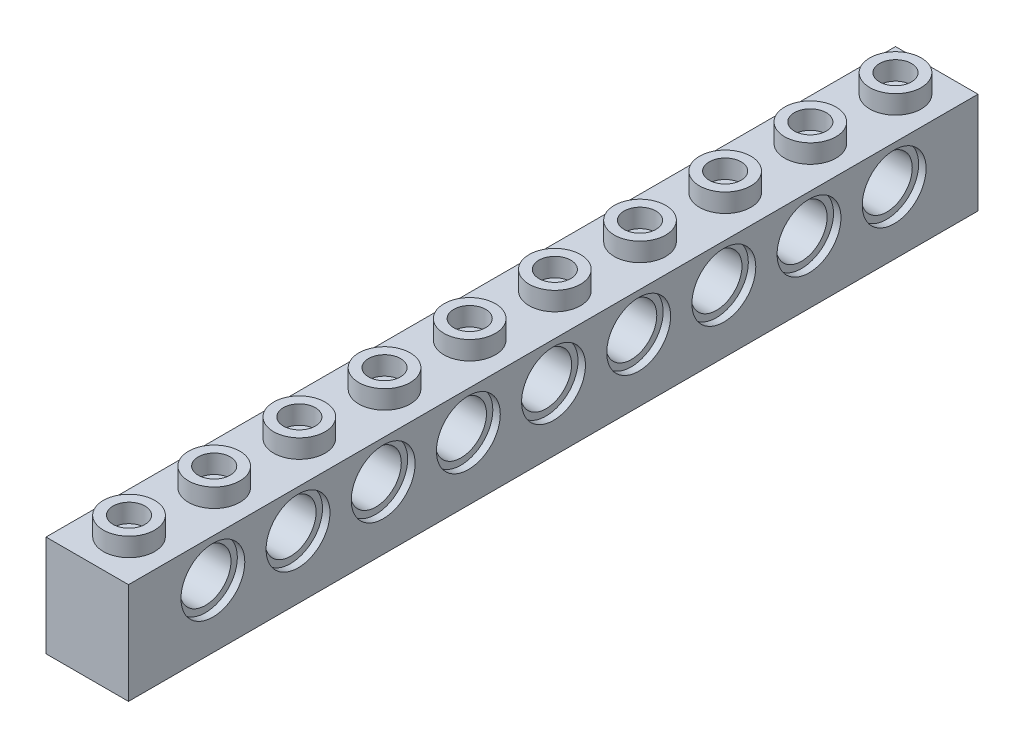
from build123d import *

# Parameters (mm, degrees)
SKETCH1_W           = 7.75
SKETCH1_H           = 9.5
BOSS_EXTRUDE1_DEPTH = 79.8
SKETCH2_R           = 2.415
SKETCH2_R_2         = 1.5
BOSS_EXTRUDE3_DEPTH = 1.75
LPATTERN1_COUNT     = 10
LPATTERN1_PITCH     = 8
SKETCH4_W           = 4.85
SKETCH4_H           = 76.9
CUT_EXTRUDE1_DEPTH  = 1.75
SKETCH5_R           = 1.5
BOSS_EXTRUDE4_DEPTH = 1.75
LPATTERN2_COUNT     = 9
LPATTERN2_PITCH     = 8
SKETCH6_R           = 3
CUT_EXTRUDE2_DEPTH  = 0.7
CUT_EXTRUDE3_START  = -0.7
SKETCH7_R           = 3
CUT_EXTRUDE3_DEPTH  = 0.7
SKETCH8_R           = 2.4
CUT_EXTRUDE4_DEPTH  = 81.438501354
LPATTERN3_COUNT     = 9
LPATTERN3_PITCH     = 8


with BuildPart() as part:
    # Sketch1 → Boss-Extrude1 (new body)
    with BuildSketch(Plane.XY):
        Rectangle(SKETCH1_W, SKETCH1_H)
    extrude(amount=BOSS_EXTRUDE1_DEPTH)

    # Sketch2 → Boss-Extrude3 (add)
    with BuildSketch(Plane(origin=(0, 4.75, 0), x_dir=(1, 0, 0), z_dir=(0, 1, 0))):
        with Locations((0, -3.875)):
            Circle(SKETCH2_R)
        with Locations(Location((0, -3.875, 0), (0, 0, 180))):
            Circle(SKETCH2_R_2, mode=Mode.SUBTRACT)
    boss_extrude3 = extrude(amount=BOSS_EXTRUDE3_DEPTH)

    # LPattern1: Boss-Extrude3 ×10
    with Locations(*[(0, 0, i * LPATTERN1_PITCH) for i in range(1, LPATTERN1_COUNT)]):
        add(boss_extrude3)

    # Sketch4 → Cut-Extrude1 (cut)
    with BuildSketch(Plane.XZ.offset(4.75)):
        with Locations((0, 39.9)):
            Rectangle(SKETCH4_W, SKETCH4_H)
    extrude(amount=-CUT_EXTRUDE1_DEPTH, mode=Mode.SUBTRACT)

    # Sketch5 → Boss-Extrude4 (add)
    with BuildSketch(Plane.XZ.offset(3)):
        with Locations(Location((0, 72.2, 0), (0, 0, 270))):
            Circle(SKETCH5_R)
    boss_extrude4 = extrude(amount=BOSS_EXTRUDE4_DEPTH)

    # LPattern2: Boss-Extrude4 ×9
    with Locations(*[(0, 0, -i * LPATTERN2_PITCH) for i in range(1, LPATTERN2_COUNT)]):
        add(boss_extrude4)

    # Sketch6 → Cut-Extrude2 (cut)
    with BuildSketch(Plane.ZY.offset(3.875)):
        with Locations((71.875, 1.15)):
            Circle(SKETCH6_R)
    cut_extrude2 = extrude(amount=-CUT_EXTRUDE2_DEPTH, mode=Mode.SUBTRACT)

    # Sketch7 → Cut-Extrude3 (cut)
    with BuildSketch(Plane(origin=(3.875, 0, 0), x_dir=(0, 0, -1), z_dir=(1, 0, 0)).offset(CUT_EXTRUDE3_START)):
        with Locations(Location((-71.875, 1.15, 0), (0, 0, 180))):
            Circle(SKETCH7_R)
    cut_extrude3 = extrude(amount=CUT_EXTRUDE3_DEPTH, mode=Mode.SUBTRACT)

    # Sketch8 → Cut-Extrude4 (cut, through all)
    with BuildSketch(Plane(origin=(3.875, 0, 0), x_dir=(0, 0, -1), z_dir=(1, 0, 0))):
        with Locations((-71.875, 1.15)):
            Circle(SKETCH8_R)
    cut_extrude4 = extrude(amount=-CUT_EXTRUDE4_DEPTH, mode=Mode.SUBTRACT)

    # LPattern3: Cut-Extrude2, Cut-Extrude3, Cut-Extrude4 ×9
    with Locations(*[(0, 0, -i * LPATTERN3_PITCH) for i in range(1, LPATTERN3_COUNT)]):
        add(cut_extrude2, mode=Mode.SUBTRACT)
        add(cut_extrude3, mode=Mode.SUBTRACT)
        add(cut_extrude4, mode=Mode.SUBTRACT)


solid = part.part
